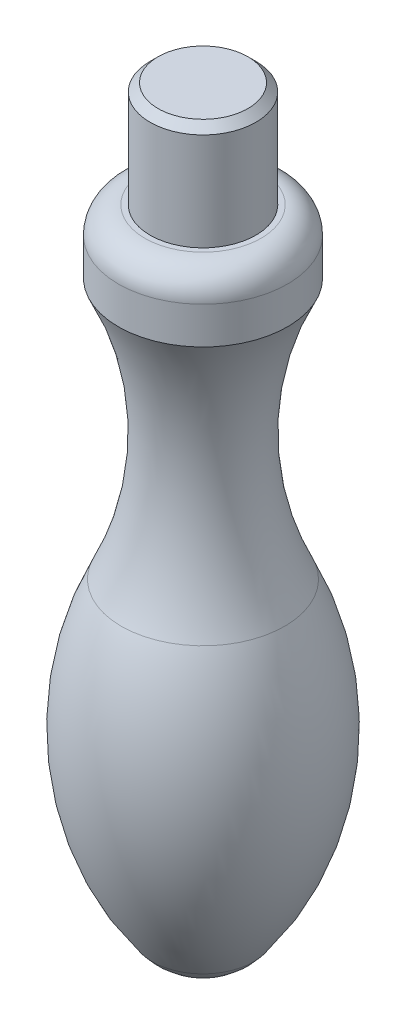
from build123d import *

# Parameters (mm, degrees)
CHAMFER1_SIZE = 0.75


with BuildPart() as part:
    # Sketch1 → Revolve1 (revolve)
    with BuildSketch(Plane.XY, mode=Mode.PRIVATE) as revolve1_sk:
        with BuildLine():
            Line((0, 0), (5, 0))
            Line((5, 0), (5, -10))
            Line((5, -10), (5.5, -10))
            ThreePointArc((5.5, -10), (7.267766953, -10.732233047), (8, -12.5))
            Line((8, -12.5), (8, -16))
            ThreePointArc((8, -16), (5.001691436, -28.301758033), (7.728862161, -40.666451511))
            ThreePointArc((7.728862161, -40.666451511), (10.314043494, -55.556311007), (4.784257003, -69.620895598))
            ThreePointArc((4.784257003, -69.620895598), (2.671575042, -71.372400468), (0, -72))
            Line((0, -72), (0, 0))
        make_face()
    revolve(revolve1_sk.sketch.rotate(Axis((0, 0, 0), (0, -1, 0)), 90), axis=Axis((0, 0, 0), (0, -1, 0)))

    # Chamfer1
    chamfer1_edges = [part.edges().sort_by_distance(p)[0] for p in [
        (0, 0, -5),
    ]]
    chamfer(chamfer1_edges, length=CHAMFER1_SIZE)


solid = part.part
